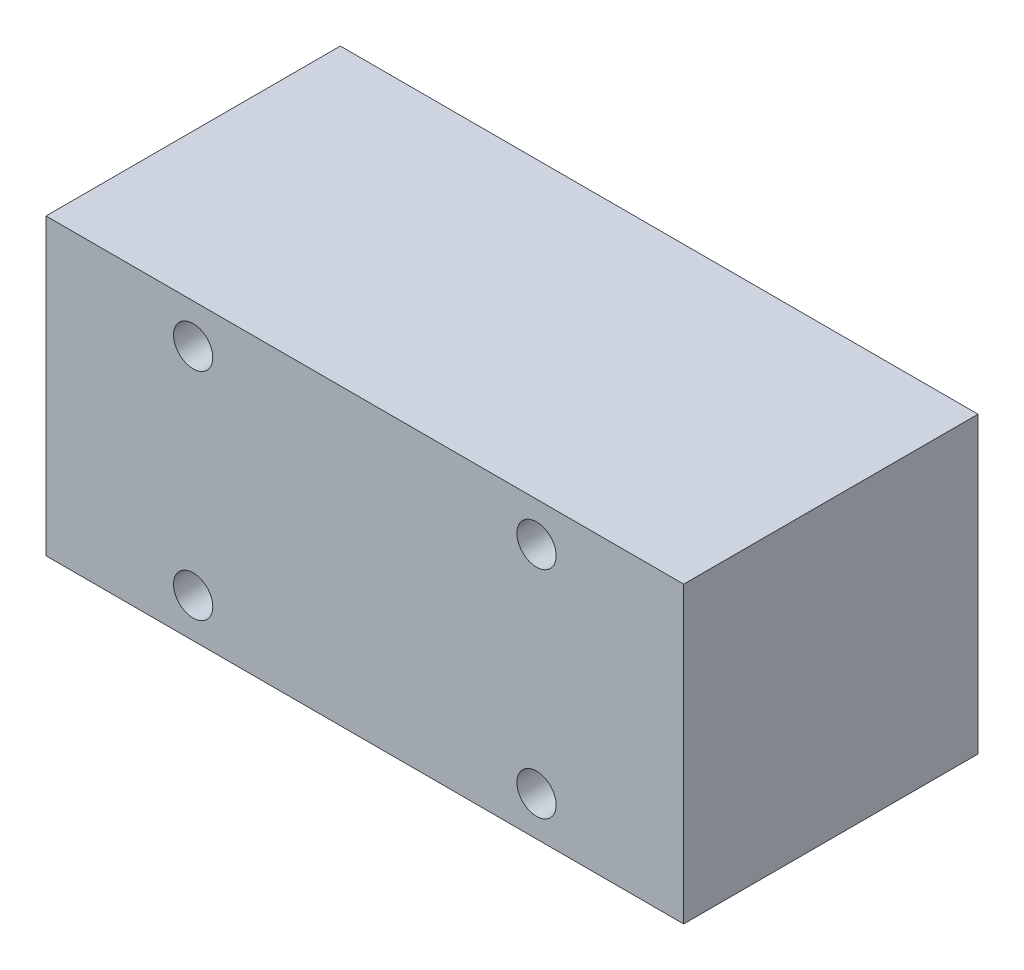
ISO-10303-21;
HEADER;
FILE_DESCRIPTION(('STEP AP214'),'2;1');
FILE_NAME('part.step','',(''),(''),'','','');
FILE_SCHEMA(('AUTOMOTIVE_DESIGN { 1 0 10303 214 1 1 1 1 }'));
ENDSEC;
DATA;
#1=APPLICATION_CONTEXT('core data for automotive mechanical design processes');
#2=APPLICATION_PROTOCOL_DEFINITION('international standard','automotive_design',2000,#1);
#3=PRODUCT_CONTEXT('',#1,'mechanical');
#4=PRODUCT('Part','Part','',(#3));
#5=PRODUCT_RELATED_PRODUCT_CATEGORY('part','',(#4));
#6=PRODUCT_DEFINITION_FORMATION('','',#4);
#7=PRODUCT_DEFINITION_CONTEXT('part definition',#1,'design');
#8=PRODUCT_DEFINITION('design','',#6,#7);
#9=PRODUCT_DEFINITION_SHAPE('','',#8);
#10=(LENGTH_UNIT() NAMED_UNIT(*) SI_UNIT(.MILLI.,.METRE.));
#11=(NAMED_UNIT(*) PLANE_ANGLE_UNIT() SI_UNIT($,.RADIAN.));
#12=(NAMED_UNIT(*) SI_UNIT($,.STERADIAN.) SOLID_ANGLE_UNIT());
#13=UNCERTAINTY_MEASURE_WITH_UNIT(LENGTH_MEASURE(1.E-05),#10,'distance_accuracy_value','');
#14=(GEOMETRIC_REPRESENTATION_CONTEXT(3) GLOBAL_UNCERTAINTY_ASSIGNED_CONTEXT((#13)) GLOBAL_UNIT_ASSIGNED_CONTEXT((#10,
#11,#12)) REPRESENTATION_CONTEXT('',''));
#15=CARTESIAN_POINT('',(0.,0.,0.));
#16=DIRECTION('',(0.,0.,1.));
#17=DIRECTION('',(1.,0.,0.));
#18=AXIS2_PLACEMENT_3D('',#15,#16,#17);
#19=CARTESIAN_POINT('',(-65.,0.,30.));
#20=DIRECTION('',(1.,0.,0.));
#21=DIRECTION('',(0.,0.,-1.));
#22=AXIS2_PLACEMENT_3D('',#19,#20,#21);
#23=PLANE('',#22);
#24=DIRECTION('',(0.,-1.,0.));
#25=VECTOR('',#24,1.);
#26=CARTESIAN_POINT('',(-65.,0.,0.));
#27=LINE('',#26,#25);
#28=CARTESIAN_POINT('',(-65.,30.,0.));
#29=VERTEX_POINT('',#28);
#30=CARTESIAN_POINT('',(-65.,0.,0.));
#31=VERTEX_POINT('',#30);
#32=EDGE_CURVE('E66',#29,#31,#27,.T.);
#33=ORIENTED_EDGE('',*,*,#32,.T.);
#34=DIRECTION('',(0.,0.,-1.));
#35=VECTOR('',#34,1.);
#36=CARTESIAN_POINT('',(-65.,0.,30.));
#37=LINE('',#36,#35);
#38=CARTESIAN_POINT('',(-65.,0.,30.));
#39=VERTEX_POINT('',#38);
#40=EDGE_CURVE('E91',#39,#31,#37,.T.);
#41=ORIENTED_EDGE('',*,*,#40,.F.);
#42=DIRECTION('',(0.,-1.,0.));
#43=VECTOR('',#42,1.);
#44=CARTESIAN_POINT('',(-65.,0.,30.));
#45=LINE('',#44,#43);
#46=CARTESIAN_POINT('',(-65.,30.,30.));
#47=VERTEX_POINT('',#46);
#48=EDGE_CURVE('E83',#47,#39,#45,.T.);
#49=ORIENTED_EDGE('',*,*,#48,.F.);
#50=DIRECTION('',(0.,0.,-1.));
#51=VECTOR('',#50,1.);
#52=CARTESIAN_POINT('',(-65.,30.,30.));
#53=LINE('',#52,#51);
#54=EDGE_CURVE('E88',#47,#29,#53,.T.);
#55=ORIENTED_EDGE('',*,*,#54,.T.);
#56=EDGE_LOOP('',(#33,#41,#49,#55));
#57=FACE_BOUND('',#56,.T.);
#58=CARTESIAN_POINT('',(-65.,15.,15.));
#59=DIRECTION('',(1.,0.,0.));
#60=DIRECTION('',(0.,0.,-1.));
#61=AXIS2_PLACEMENT_3D('',#58,#59,#60);
#62=CIRCLE('',#61,3.);
#63=CARTESIAN_POINT('',(-65.,15.,12.));
#64=VERTEX_POINT('',#63);
#65=EDGE_CURVE('E11',#64,#64,#62,.F.);
#66=ORIENTED_EDGE('',*,*,#65,.F.);
#67=EDGE_LOOP('',(#66));
#68=FACE_BOUND('',#67,.T.);
#69=ADVANCED_FACE('F32',(#57,#68),#23,.F.);
#70=CARTESIAN_POINT('',(0.,0.,30.));
#71=DIRECTION('',(-1.,0.,0.));
#72=DIRECTION('',(0.,0.,1.));
#73=AXIS2_PLACEMENT_3D('',#70,#71,#72);
#74=PLANE('',#73);
#75=DIRECTION('',(0.,1.,0.));
#76=VECTOR('',#75,1.);
#77=CARTESIAN_POINT('',(0.,0.,0.));
#78=LINE('',#77,#76);
#79=CARTESIAN_POINT('',(0.,0.,0.));
#80=VERTEX_POINT('',#79);
#81=CARTESIAN_POINT('',(0.,30.,0.));
#82=VERTEX_POINT('',#81);
#83=EDGE_CURVE('E99',#80,#82,#78,.T.);
#84=ORIENTED_EDGE('',*,*,#83,.T.);
#85=DIRECTION('',(0.,0.,-1.));
#86=VECTOR('',#85,1.);
#87=CARTESIAN_POINT('',(0.,30.,30.));
#88=LINE('',#87,#86);
#89=CARTESIAN_POINT('',(0.,30.,30.));
#90=VERTEX_POINT('',#89);
#91=EDGE_CURVE('E41',#90,#82,#88,.T.);
#92=ORIENTED_EDGE('',*,*,#91,.F.);
#93=DIRECTION('',(0.,1.,0.));
#94=VECTOR('',#93,1.);
#95=CARTESIAN_POINT('',(0.,0.,30.));
#96=LINE('',#95,#94);
#97=CARTESIAN_POINT('',(0.,0.,30.));
#98=VERTEX_POINT('',#97);
#99=EDGE_CURVE('E85',#98,#90,#96,.T.);
#100=ORIENTED_EDGE('',*,*,#99,.F.);
#101=DIRECTION('',(0.,0.,-1.));
#102=VECTOR('',#101,1.);
#103=CARTESIAN_POINT('',(0.,0.,30.));
#104=LINE('',#103,#102);
#105=EDGE_CURVE('E95',#98,#80,#104,.T.);
#106=ORIENTED_EDGE('',*,*,#105,.T.);
#107=EDGE_LOOP('',(#84,#92,#100,#106));
#108=FACE_BOUND('',#107,.T.);
#109=ADVANCED_FACE('F34',(#108),#74,.F.);
#110=CARTESIAN_POINT('',(0.,30.,30.));
#111=DIRECTION('',(0.,-1.,0.));
#112=DIRECTION('',(1.,0.,0.));
#113=AXIS2_PLACEMENT_3D('',#110,#111,#112);
#114=PLANE('',#113);
#115=DIRECTION('',(-1.,0.,0.));
#116=VECTOR('',#115,1.);
#117=CARTESIAN_POINT('',(0.,30.,0.));
#118=LINE('',#117,#116);
#119=EDGE_CURVE('E90',#82,#29,#118,.T.);
#120=ORIENTED_EDGE('',*,*,#119,.T.);
#121=ORIENTED_EDGE('',*,*,#54,.F.);
#122=DIRECTION('',(-1.,0.,0.));
#123=VECTOR('',#122,1.);
#124=CARTESIAN_POINT('',(0.,30.,30.));
#125=LINE('',#124,#123);
#126=EDGE_CURVE('E80',#90,#47,#125,.T.);
#127=ORIENTED_EDGE('',*,*,#126,.F.);
#128=ORIENTED_EDGE('',*,*,#91,.T.);
#129=EDGE_LOOP('',(#120,#121,#127,#128));
#130=FACE_BOUND('',#129,.T.);
#131=ADVANCED_FACE('F89',(#130),#114,.F.);
#132=CARTESIAN_POINT('',(0.,0.,30.));
#133=DIRECTION('',(0.,1.,0.));
#134=DIRECTION('',(-1.,0.,0.));
#135=AXIS2_PLACEMENT_3D('',#132,#133,#134);
#136=PLANE('',#135);
#137=DIRECTION('',(1.,0.,0.));
#138=VECTOR('',#137,1.);
#139=CARTESIAN_POINT('',(0.,0.,0.));
#140=LINE('',#139,#138);
#141=EDGE_CURVE('E72',#31,#80,#140,.T.);
#142=ORIENTED_EDGE('',*,*,#141,.T.);
#143=ORIENTED_EDGE('',*,*,#105,.F.);
#144=DIRECTION('',(1.,0.,0.));
#145=VECTOR('',#144,1.);
#146=CARTESIAN_POINT('',(0.,0.,30.));
#147=LINE('',#146,#145);
#148=EDGE_CURVE('E49',#39,#98,#147,.T.);
#149=ORIENTED_EDGE('',*,*,#148,.F.);
#150=ORIENTED_EDGE('',*,*,#40,.T.);
#151=EDGE_LOOP('',(#142,#143,#149,#150));
#152=FACE_BOUND('',#151,.T.);
#153=ADVANCED_FACE('F121',(#152),#136,.F.);
#154=CARTESIAN_POINT('',(0.,30.,30.));
#155=DIRECTION('',(0.,0.,1.));
#156=DIRECTION('',(1.,0.,0.));
#157=AXIS2_PLACEMENT_3D('',#154,#155,#156);
#158=PLANE('',#157);
#159=CARTESIAN_POINT('',(-15.,26.,30.));
#160=DIRECTION('',(0.,0.,1.));
#161=DIRECTION('',(1.,0.,0.));
#162=AXIS2_PLACEMENT_3D('',#159,#160,#161);
#163=CIRCLE('',#162,2.);
#164=CARTESIAN_POINT('',(-13.,26.,30.));
#165=VERTEX_POINT('',#164);
#166=EDGE_CURVE('E248',#165,#165,#163,.T.);
#167=ORIENTED_EDGE('',*,*,#166,.F.);
#168=EDGE_LOOP('',(#167));
#169=FACE_BOUND('',#168,.T.);
#170=CARTESIAN_POINT('',(-15.,3.99999999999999,30.));
#171=DIRECTION('',(0.,0.,1.));
#172=DIRECTION('',(1.,0.,0.));
#173=AXIS2_PLACEMENT_3D('',#170,#171,#172);
#174=CIRCLE('',#173,2.);
#175=CARTESIAN_POINT('',(-13.,3.99999999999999,30.));
#176=VERTEX_POINT('',#175);
#177=EDGE_CURVE('E255',#176,#176,#174,.T.);
#178=ORIENTED_EDGE('',*,*,#177,.F.);
#179=EDGE_LOOP('',(#178));
#180=FACE_BOUND('',#179,.T.);
#181=CARTESIAN_POINT('',(-50.,3.99999999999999,30.));
#182=DIRECTION('',(0.,0.,1.));
#183=DIRECTION('',(1.,0.,0.));
#184=AXIS2_PLACEMENT_3D('',#181,#182,#183);
#185=CIRCLE('',#184,2.);
#186=CARTESIAN_POINT('',(-48.,3.99999999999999,30.));
#187=VERTEX_POINT('',#186);
#188=EDGE_CURVE('E260',#187,#187,#185,.T.);
#189=ORIENTED_EDGE('',*,*,#188,.F.);
#190=EDGE_LOOP('',(#189));
#191=FACE_BOUND('',#190,.T.);
#192=CARTESIAN_POINT('',(-50.,26.,30.));
#193=DIRECTION('',(0.,0.,1.));
#194=DIRECTION('',(1.,0.,0.));
#195=AXIS2_PLACEMENT_3D('',#192,#193,#194);
#196=CIRCLE('',#195,2.);
#197=CARTESIAN_POINT('',(-48.,26.,30.));
#198=VERTEX_POINT('',#197);
#199=EDGE_CURVE('E266',#198,#198,#196,.T.);
#200=ORIENTED_EDGE('',*,*,#199,.F.);
#201=EDGE_LOOP('',(#200));
#202=FACE_BOUND('',#201,.T.);
#203=ORIENTED_EDGE('',*,*,#99,.T.);
#204=ORIENTED_EDGE('',*,*,#126,.T.);
#205=ORIENTED_EDGE('',*,*,#48,.T.);
#206=ORIENTED_EDGE('',*,*,#148,.T.);
#207=EDGE_LOOP('',(#203,#204,#205,#206));
#208=FACE_BOUND('',#207,.T.);
#209=ADVANCED_FACE('F81',(#169,#180,#191,#202,#208),#158,.T.);
#210=CARTESIAN_POINT('',(0.,30.,0.));
#211=DIRECTION('',(0.,0.,1.));
#212=DIRECTION('',(1.,0.,0.));
#213=AXIS2_PLACEMENT_3D('',#210,#211,#212);
#214=PLANE('',#213);
#215=ORIENTED_EDGE('',*,*,#83,.F.);
#216=ORIENTED_EDGE('',*,*,#141,.F.);
#217=ORIENTED_EDGE('',*,*,#32,.F.);
#218=ORIENTED_EDGE('',*,*,#119,.F.);
#219=EDGE_LOOP('',(#215,#216,#217,#218));
#220=FACE_BOUND('',#219,.T.);
#221=ADVANCED_FACE('F110',(#220),#214,.F.);
#222=CARTESIAN_POINT('',(-50.,26.,20.));
#223=DIRECTION('',(0.,0.,1.));
#224=DIRECTION('',(1.,0.,0.));
#225=AXIS2_PLACEMENT_3D('',#222,#223,#224);
#226=CYLINDRICAL_SURFACE('',#225,2.);
#227=CARTESIAN_POINT('',(-50.,26.,20.));
#228=DIRECTION('',(0.,0.,1.));
#229=DIRECTION('',(1.,0.,0.));
#230=AXIS2_PLACEMENT_3D('',#227,#228,#229);
#231=CIRCLE('',#230,2.);
#232=CARTESIAN_POINT('',(-48.,26.,20.));
#233=VERTEX_POINT('',#232);
#234=EDGE_CURVE('E102',#233,#233,#231,.T.);
#235=ORIENTED_EDGE('',*,*,#234,.F.);
#236=EDGE_LOOP('',(#235));
#237=FACE_BOUND('',#236,.T.);
#238=ORIENTED_EDGE('',*,*,#199,.T.);
#239=EDGE_LOOP('',(#238));
#240=FACE_BOUND('',#239,.T.);
#241=ADVANCED_FACE('F112',(#237,#240),#226,.F.);
#242=CARTESIAN_POINT('',(-50.,26.,20.));
#243=DIRECTION('',(0.,0.,1.));
#244=DIRECTION('',(1.,0.,0.));
#245=AXIS2_PLACEMENT_3D('',#242,#243,#244);
#246=PLANE('',#245);
#247=ORIENTED_EDGE('',*,*,#234,.T.);
#248=EDGE_LOOP('',(#247));
#249=FACE_BOUND('',#248,.T.);
#250=ADVANCED_FACE('F118',(#249),#246,.T.);
#251=CARTESIAN_POINT('',(-50.,3.99999999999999,20.));
#252=DIRECTION('',(0.,0.,1.));
#253=DIRECTION('',(1.,0.,0.));
#254=AXIS2_PLACEMENT_3D('',#251,#252,#253);
#255=CYLINDRICAL_SURFACE('',#254,2.);
#256=CARTESIAN_POINT('',(-50.,3.99999999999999,20.));
#257=DIRECTION('',(0.,0.,1.));
#258=DIRECTION('',(1.,0.,0.));
#259=AXIS2_PLACEMENT_3D('',#256,#257,#258);
#260=CIRCLE('',#259,2.);
#261=CARTESIAN_POINT('',(-48.,3.99999999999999,20.));
#262=VERTEX_POINT('',#261);
#263=EDGE_CURVE('E263',#262,#262,#260,.T.);
#264=ORIENTED_EDGE('',*,*,#263,.F.);
#265=EDGE_LOOP('',(#264));
#266=FACE_BOUND('',#265,.T.);
#267=ORIENTED_EDGE('',*,*,#188,.T.);
#268=EDGE_LOOP('',(#267));
#269=FACE_BOUND('',#268,.T.);
#270=ADVANCED_FACE('F157',(#266,#269),#255,.F.);
#271=CARTESIAN_POINT('',(-50.,3.99999999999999,20.));
#272=DIRECTION('',(0.,0.,1.));
#273=DIRECTION('',(1.,0.,0.));
#274=AXIS2_PLACEMENT_3D('',#271,#272,#273);
#275=PLANE('',#274);
#276=ORIENTED_EDGE('',*,*,#263,.T.);
#277=EDGE_LOOP('',(#276));
#278=FACE_BOUND('',#277,.T.);
#279=ADVANCED_FACE('F167',(#278),#275,.T.);
#280=CARTESIAN_POINT('',(-15.,3.99999999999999,20.));
#281=DIRECTION('',(0.,0.,1.));
#282=DIRECTION('',(1.,0.,0.));
#283=AXIS2_PLACEMENT_3D('',#280,#281,#282);
#284=CYLINDRICAL_SURFACE('',#283,2.);
#285=CARTESIAN_POINT('',(-15.,3.99999999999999,20.));
#286=DIRECTION('',(0.,0.,1.));
#287=DIRECTION('',(1.,0.,0.));
#288=AXIS2_PLACEMENT_3D('',#285,#286,#287);
#289=CIRCLE('',#288,2.);
#290=CARTESIAN_POINT('',(-13.,3.99999999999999,20.));
#291=VERTEX_POINT('',#290);
#292=EDGE_CURVE('E257',#291,#291,#289,.T.);
#293=ORIENTED_EDGE('',*,*,#292,.F.);
#294=EDGE_LOOP('',(#293));
#295=FACE_BOUND('',#294,.T.);
#296=ORIENTED_EDGE('',*,*,#177,.T.);
#297=EDGE_LOOP('',(#296));
#298=FACE_BOUND('',#297,.T.);
#299=ADVANCED_FACE('F177',(#295,#298),#284,.F.);
#300=CARTESIAN_POINT('',(-15.,3.99999999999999,20.));
#301=DIRECTION('',(0.,0.,1.));
#302=DIRECTION('',(1.,0.,0.));
#303=AXIS2_PLACEMENT_3D('',#300,#301,#302);
#304=PLANE('',#303);
#305=ORIENTED_EDGE('',*,*,#292,.T.);
#306=EDGE_LOOP('',(#305));
#307=FACE_BOUND('',#306,.T.);
#308=ADVANCED_FACE('F187',(#307),#304,.T.);
#309=CARTESIAN_POINT('',(-15.,26.,20.));
#310=DIRECTION('',(0.,0.,1.));
#311=DIRECTION('',(1.,0.,0.));
#312=AXIS2_PLACEMENT_3D('',#309,#310,#311);
#313=CYLINDRICAL_SURFACE('',#312,2.);
#314=CARTESIAN_POINT('',(-15.,26.,20.));
#315=DIRECTION('',(0.,0.,1.));
#316=DIRECTION('',(1.,0.,0.));
#317=AXIS2_PLACEMENT_3D('',#314,#315,#316);
#318=CIRCLE('',#317,2.);
#319=CARTESIAN_POINT('',(-13.,26.,20.));
#320=VERTEX_POINT('',#319);
#321=EDGE_CURVE('E251',#320,#320,#318,.T.);
#322=ORIENTED_EDGE('',*,*,#321,.F.);
#323=EDGE_LOOP('',(#322));
#324=FACE_BOUND('',#323,.T.);
#325=ORIENTED_EDGE('',*,*,#166,.T.);
#326=EDGE_LOOP('',(#325));
#327=FACE_BOUND('',#326,.T.);
#328=ADVANCED_FACE('F197',(#324,#327),#313,.F.);
#329=CARTESIAN_POINT('',(-15.,26.,20.));
#330=DIRECTION('',(0.,0.,1.));
#331=DIRECTION('',(1.,0.,0.));
#332=AXIS2_PLACEMENT_3D('',#329,#330,#331);
#333=PLANE('',#332);
#334=ORIENTED_EDGE('',*,*,#321,.T.);
#335=EDGE_LOOP('',(#334));
#336=FACE_BOUND('',#335,.T.);
#337=ADVANCED_FACE('F207',(#336),#333,.T.);
#338=CARTESIAN_POINT('',(-75.,15.,15.));
#339=DIRECTION('',(1.,0.,0.));
#340=DIRECTION('',(0.,0.,-1.));
#341=AXIS2_PLACEMENT_3D('',#338,#339,#340);
#342=CYLINDRICAL_SURFACE('',#341,3.);
#343=CARTESIAN_POINT('',(-75.,15.,15.));
#344=DIRECTION('',(-1.,0.,0.));
#345=DIRECTION('',(0.,0.,1.));
#346=AXIS2_PLACEMENT_3D('',#343,#344,#345);
#347=CIRCLE('',#346,3.);
#348=CARTESIAN_POINT('',(-75.,15.,18.));
#349=VERTEX_POINT('',#348);
#350=EDGE_CURVE('E247',#349,#349,#347,.T.);
#351=ORIENTED_EDGE('',*,*,#350,.F.);
#352=EDGE_LOOP('',(#351));
#353=FACE_BOUND('',#352,.T.);
#354=ORIENTED_EDGE('',*,*,#65,.T.);
#355=EDGE_LOOP('',(#354));
#356=FACE_BOUND('',#355,.T.);
#357=ADVANCED_FACE('F216',(#353,#356),#342,.T.);
#358=CARTESIAN_POINT('',(-75.,15.,15.));
#359=DIRECTION('',(-1.,0.,0.));
#360=DIRECTION('',(0.,0.,1.));
#361=AXIS2_PLACEMENT_3D('',#358,#359,#360);
#362=PLANE('',#361);
#363=ORIENTED_EDGE('',*,*,#350,.T.);
#364=EDGE_LOOP('',(#363));
#365=FACE_BOUND('',#364,.T.);
#366=ADVANCED_FACE('F231',(#365),#362,.T.);
#367=CLOSED_SHELL('',(#69,#109,#131,#153,#209,#221,#241,#250,#270,#279,#299,#308,#328,#337,#357,#366));
#368=MANIFOLD_SOLID_BREP('B2',#367);
#369=ADVANCED_BREP_SHAPE_REPRESENTATION('',(#18,#368),#14);
#370=SHAPE_DEFINITION_REPRESENTATION(#9,#369);
ENDSEC;
END-ISO-10303-21;
